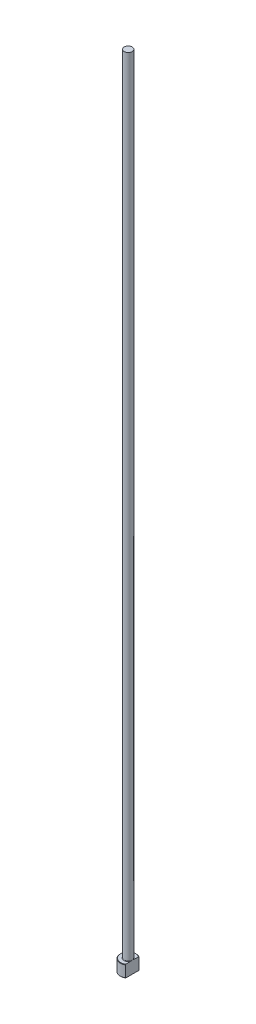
from build123d import *
from build123d.topology import SkipClean

# Parameters (mm, degrees)
CHAMFER1_SIZE    = 0.2
FILLET1_R        = 0.2
KEYED_HEAD_DEPTH = 401.039998


with BuildPart() as part:
    # Sketch1 → Revolve1 (revolve)
    with BuildSketch(Plane.XY, mode=Mode.PRIVATE) as revolve1_sk:
        Polygon((0, 0), (-4, 0), (-4, 6), (-2, 6), (-2, 400), (0, 400), align=None)
    revolve(revolve1_sk.sketch.rotate(Axis((0, 259.958771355, 0), (0, -1, 0)), 270), axis=Axis((0, 259.958771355, 0), (0, -1, 0)))

    # Chamfer1
    chamfer1_edges = [part.edges().sort_by_distance(p)[0] for p in [
        (0, 6, -4),
        (0, 0, -4),
    ]]
    chamfer(chamfer1_edges, length=CHAMFER1_SIZE)

    # Fillet1
    fillet1_edges = [part.edges().sort_by_distance(p)[0] for p in [
        (0, 6, -2),
    ]]
    fillet(fillet1_edges, radius=FILLET1_R)

    # Sketch2 → KEYED HEAD (cut, through all)
    with SkipClean():  # the faces are left unmerged after this step: merging them gives an invalid solid
        with BuildSketch(Plane(origin=(0, 0, 0), x_dir=(1, 0, 0), z_dir=(0, 1, 0))):
            with BuildLine():
                Line((2, -3.464101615), (2, 3.464101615))
                ThreePointArc((2, 3.464101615), (4, 0), (2, -3.464101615))
            make_face()
        extrude(amount=KEYED_HEAD_DEPTH, mode=Mode.SUBTRACT)


solid = part.part
